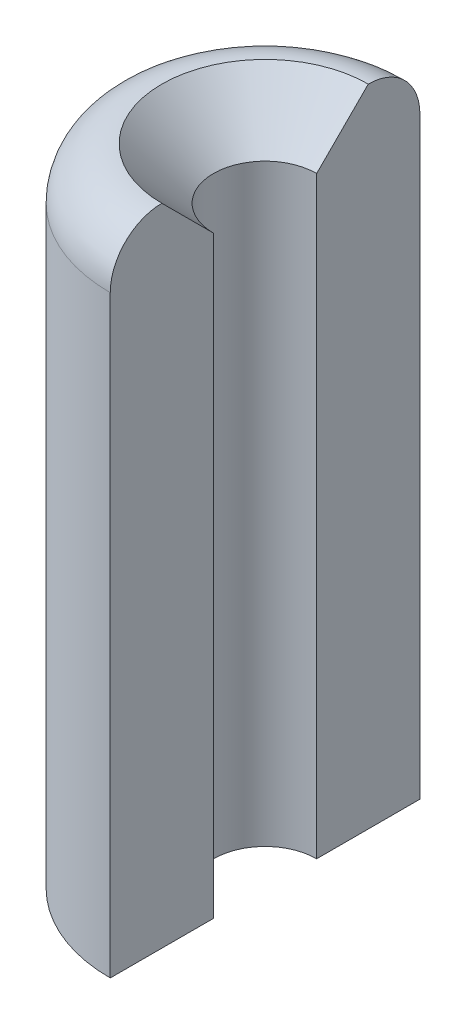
ISO-10303-21;
HEADER;
FILE_DESCRIPTION(('STEP AP214'),'2;1');
FILE_NAME('part.step','',(''),(''),'','','');
FILE_SCHEMA(('AUTOMOTIVE_DESIGN { 1 0 10303 214 1 1 1 1 }'));
ENDSEC;
DATA;
#1=APPLICATION_CONTEXT('core data for automotive mechanical design processes');
#2=APPLICATION_PROTOCOL_DEFINITION('international standard','automotive_design',2000,#1);
#3=PRODUCT_CONTEXT('',#1,'mechanical');
#4=PRODUCT('Part','Part','',(#3));
#5=PRODUCT_RELATED_PRODUCT_CATEGORY('part','',(#4));
#6=PRODUCT_DEFINITION_FORMATION('','',#4);
#7=PRODUCT_DEFINITION_CONTEXT('part definition',#1,'design');
#8=PRODUCT_DEFINITION('design','',#6,#7);
#9=PRODUCT_DEFINITION_SHAPE('','',#8);
#10=(LENGTH_UNIT() NAMED_UNIT(*) SI_UNIT(.MILLI.,.METRE.));
#11=(NAMED_UNIT(*) PLANE_ANGLE_UNIT() SI_UNIT($,.RADIAN.));
#12=(NAMED_UNIT(*) SI_UNIT($,.STERADIAN.) SOLID_ANGLE_UNIT());
#13=UNCERTAINTY_MEASURE_WITH_UNIT(LENGTH_MEASURE(1.E-05),#10,'distance_accuracy_value','');
#14=(GEOMETRIC_REPRESENTATION_CONTEXT(3) GLOBAL_UNCERTAINTY_ASSIGNED_CONTEXT((#13)) GLOBAL_UNIT_ASSIGNED_CONTEXT((#10,
#11,#12)) REPRESENTATION_CONTEXT('',''));
#15=CARTESIAN_POINT('',(0.,0.,0.));
#16=DIRECTION('',(0.,0.,1.));
#17=DIRECTION('',(1.,0.,0.));
#18=AXIS2_PLACEMENT_3D('',#15,#16,#17);
#19=CARTESIAN_POINT('',(0.,0.,-10.));
#20=DIRECTION('',(0.,-1.,0.));
#21=DIRECTION('',(0.,0.,-1.));
#22=AXIS2_PLACEMENT_3D('',#19,#20,#21);
#23=PLANE('',#22);
#24=DIRECTION('',(0.,0.,-1.));
#25=VECTOR('',#24,1.);
#26=CARTESIAN_POINT('',(-1.5,0.,1.26994984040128));
#27=LINE('',#26,#25);
#28=CARTESIAN_POINT('',(-1.5,0.,-2.));
#29=VERTEX_POINT('',#28);
#30=CARTESIAN_POINT('',(-1.5,1.1369377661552E-11,-4.));
#31=VERTEX_POINT('',#30);
#32=EDGE_CURVE('E56',#29,#31,#27,.T.);
#33=ORIENTED_EDGE('',*,*,#32,.F.);
#34=CARTESIAN_POINT('',(-1.5,0.,-5.));
#35=DIRECTION('',(0.,-1.,0.));
#36=DIRECTION('',(0.,0.,-1.));
#37=AXIS2_PLACEMENT_3D('',#34,#35,#36);
#38=CIRCLE('',#37,3.);
#39=CARTESIAN_POINT('',(-1.5,0.,-8.));
#40=VERTEX_POINT('',#39);
#41=EDGE_CURVE('E41',#29,#40,#38,.T.);
#42=ORIENTED_EDGE('',*,*,#41,.T.);
#43=CARTESIAN_POINT('',(-1.5,1.1369377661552E-11,-6.));
#44=VERTEX_POINT('',#43);
#45=EDGE_CURVE('E80',#44,#40,#27,.T.);
#46=ORIENTED_EDGE('',*,*,#45,.F.);
#47=CARTESIAN_POINT('',(-1.5,1.1369377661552E-11,-5.));
#48=DIRECTION('',(0.,1.,0.));
#49=DIRECTION('',(0.,0.,1.));
#50=AXIS2_PLACEMENT_3D('',#47,#48,#49);
#51=CIRCLE('',#50,0.999999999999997);
#52=EDGE_CURVE('E90',#44,#31,#51,.T.);
#53=ORIENTED_EDGE('',*,*,#52,.T.);
#54=EDGE_LOOP('',(#33,#42,#46,#53));
#55=FACE_BOUND('',#54,.T.);
#56=ADVANCED_FACE('F34',(#55),#23,.T.);
#57=CARTESIAN_POINT('',(-1.5,12.5,-5.));
#58=DIRECTION('',(0.,-1.,0.));
#59=DIRECTION('',(0.,0.,-1.));
#60=AXIS2_PLACEMENT_3D('',#57,#58,#59);
#61=CYLINDRICAL_SURFACE('',#60,3.);
#62=DIRECTION('',(0.,-1.,0.));
#63=VECTOR('',#62,1.);
#64=CARTESIAN_POINT('',(-1.5,0.,-2.));
#65=LINE('',#64,#63);
#66=CARTESIAN_POINT('',(-1.5,11.5,-2.));
#67=VERTEX_POINT('',#66);
#68=EDGE_CURVE('E108',#67,#29,#65,.T.);
#69=ORIENTED_EDGE('',*,*,#68,.F.);
#70=CARTESIAN_POINT('',(-1.5,11.5,-5.));
#71=DIRECTION('',(0.,-1.,0.));
#72=DIRECTION('',(0.,0.,-1.));
#73=AXIS2_PLACEMENT_3D('',#70,#71,#72);
#74=CIRCLE('',#73,3.);
#75=CARTESIAN_POINT('',(-1.5,11.5,-8.));
#76=VERTEX_POINT('',#75);
#77=EDGE_CURVE('E13',#67,#76,#74,.T.);
#78=ORIENTED_EDGE('',*,*,#77,.T.);
#79=DIRECTION('',(0.,1.,0.));
#80=VECTOR('',#79,1.);
#81=CARTESIAN_POINT('',(-1.5,0.,-8.));
#82=LINE('',#81,#80);
#83=EDGE_CURVE('E107',#40,#76,#82,.T.);
#84=ORIENTED_EDGE('',*,*,#83,.F.);
#85=ORIENTED_EDGE('',*,*,#41,.F.);
#86=EDGE_LOOP('',(#69,#78,#84,#85));
#87=FACE_BOUND('',#86,.T.);
#88=ADVANCED_FACE('F119',(#87),#61,.T.);
#89=CARTESIAN_POINT('',(-1.5,11.5,-5.));
#90=DIRECTION('',(0.,-1.,0.));
#91=DIRECTION('',(0.,0.,-1.));
#92=AXIS2_PLACEMENT_3D('',#89,#90,#91);
#93=TOROIDAL_SURFACE('',#92,2.,1.);
#94=CARTESIAN_POINT('',(-1.5,11.5,-3.));
#95=DIRECTION('',(-1.,0.,0.));
#96=DIRECTION('',(0.,0.,1.));
#97=AXIS2_PLACEMENT_3D('',#94,#95,#96);
#98=CIRCLE('',#97,1.);
#99=CARTESIAN_POINT('',(-1.5,12.5,-3.));
#100=VERTEX_POINT('',#99);
#101=EDGE_CURVE('E96',#67,#100,#98,.T.);
#102=ORIENTED_EDGE('',*,*,#101,.T.);
#103=CARTESIAN_POINT('',(-1.5,12.5,-5.));
#104=DIRECTION('',(0.,1.,0.));
#105=DIRECTION('',(0.,0.,1.));
#106=AXIS2_PLACEMENT_3D('',#103,#104,#105);
#107=CIRCLE('',#106,2.);
#108=CARTESIAN_POINT('',(-1.5,12.5,-7.));
#109=VERTEX_POINT('',#108);
#110=EDGE_CURVE('E98',#109,#100,#107,.T.);
#111=ORIENTED_EDGE('',*,*,#110,.F.);
#112=CARTESIAN_POINT('',(-1.5,11.5,-7.));
#113=DIRECTION('',(-1.,0.,0.));
#114=DIRECTION('',(0.,0.,1.));
#115=AXIS2_PLACEMENT_3D('',#112,#113,#114);
#116=CIRCLE('',#115,1.);
#117=EDGE_CURVE('E111',#109,#76,#116,.T.);
#118=ORIENTED_EDGE('',*,*,#117,.T.);
#119=ORIENTED_EDGE('',*,*,#77,.F.);
#120=EDGE_LOOP('',(#102,#111,#118,#119));
#121=FACE_BOUND('',#120,.T.);
#122=ADVANCED_FACE('F116',(#121),#93,.T.);
#123=CARTESIAN_POINT('',(-1.5,12.5,-5.));
#124=DIRECTION('',(0.,1.,0.));
#125=DIRECTION('',(0.,0.,1.));
#126=AXIS2_PLACEMENT_3D('',#123,#124,#125);
#127=CONICAL_SURFACE('',#126,2.,0.785398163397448);
#128=ORIENTED_EDGE('',*,*,#110,.T.);
#129=DIRECTION('',(0.,0.707106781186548,0.707106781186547));
#130=VECTOR('',#129,1.);
#131=CARTESIAN_POINT('',(-1.5,10.5,-5.));
#132=LINE('',#131,#130);
#133=CARTESIAN_POINT('',(-1.5,11.5,-4.));
#134=VERTEX_POINT('',#133);
#135=EDGE_CURVE('E101',#134,#100,#132,.T.);
#136=ORIENTED_EDGE('',*,*,#135,.F.);
#137=CARTESIAN_POINT('',(-1.5,11.5,-5.));
#138=DIRECTION('',(0.,1.,0.));
#139=DIRECTION('',(0.,0.,1.));
#140=AXIS2_PLACEMENT_3D('',#137,#138,#139);
#141=CIRCLE('',#140,0.999999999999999);
#142=CARTESIAN_POINT('',(-1.5,11.5,-6.));
#143=VERTEX_POINT('',#142);
#144=EDGE_CURVE('E95',#143,#134,#141,.T.);
#145=ORIENTED_EDGE('',*,*,#144,.F.);
#146=DIRECTION('',(0.,-0.707106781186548,0.707106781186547));
#147=VECTOR('',#146,1.);
#148=CARTESIAN_POINT('',(-1.5,10.5,-5.));
#149=LINE('',#148,#147);
#150=EDGE_CURVE('E48',#109,#143,#149,.T.);
#151=ORIENTED_EDGE('',*,*,#150,.F.);
#152=EDGE_LOOP('',(#128,#136,#145,#151));
#153=FACE_BOUND('',#152,.T.);
#154=ADVANCED_FACE('F125',(#153),#127,.F.);
#155=CARTESIAN_POINT('',(-1.5,12.5,-5.));
#156=DIRECTION('',(0.,1.,0.));
#157=DIRECTION('',(0.,0.,1.));
#158=AXIS2_PLACEMENT_3D('',#155,#156,#157);
#159=CYLINDRICAL_SURFACE('',#158,0.999999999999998);
#160=ORIENTED_EDGE('',*,*,#144,.T.);
#161=DIRECTION('',(0.,1.,0.));
#162=VECTOR('',#161,1.);
#163=CARTESIAN_POINT('',(-1.5,12.5,-4.));
#164=LINE('',#163,#162);
#165=EDGE_CURVE('E94',#31,#134,#164,.T.);
#166=ORIENTED_EDGE('',*,*,#165,.F.);
#167=ORIENTED_EDGE('',*,*,#52,.F.);
#168=DIRECTION('',(0.,1.,0.));
#169=VECTOR('',#168,1.);
#170=CARTESIAN_POINT('',(-1.5,12.5,-6.));
#171=LINE('',#170,#169);
#172=EDGE_CURVE('E77',#143,#44,#171,.F.);
#173=ORIENTED_EDGE('',*,*,#172,.F.);
#174=EDGE_LOOP('',(#160,#166,#167,#173));
#175=FACE_BOUND('',#174,.T.);
#176=ADVANCED_FACE('F93',(#175),#159,.F.);
#177=CARTESIAN_POINT('',(-1.5,14.2990196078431,1.26994984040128));
#178=DIRECTION('',(-1.,0.,0.));
#179=DIRECTION('',(0.,0.,1.));
#180=AXIS2_PLACEMENT_3D('',#177,#178,#179);
#181=PLANE('',#180);
#182=ORIENTED_EDGE('',*,*,#83,.T.);
#183=ORIENTED_EDGE('',*,*,#117,.F.);
#184=ORIENTED_EDGE('',*,*,#150,.T.);
#185=ORIENTED_EDGE('',*,*,#172,.T.);
#186=ORIENTED_EDGE('',*,*,#45,.T.);
#187=EDGE_LOOP('',(#182,#183,#184,#185,#186));
#188=FACE_BOUND('',#187,.T.);
#189=ADVANCED_FACE('F79',(#188),#181,.F.);
#190=ORIENTED_EDGE('',*,*,#68,.T.);
#191=ORIENTED_EDGE('',*,*,#32,.T.);
#192=ORIENTED_EDGE('',*,*,#165,.T.);
#193=ORIENTED_EDGE('',*,*,#135,.T.);
#194=ORIENTED_EDGE('',*,*,#101,.F.);
#195=EDGE_LOOP('',(#190,#191,#192,#193,#194));
#196=FACE_BOUND('',#195,.T.);
#197=ADVANCED_FACE('F120',(#196),#181,.F.);
#198=CLOSED_SHELL('',(#56,#88,#122,#154,#176,#189,#197));
#199=MANIFOLD_SOLID_BREP('B2',#198);
#200=ADVANCED_BREP_SHAPE_REPRESENTATION('',(#18,#199),#14);
#201=SHAPE_DEFINITION_REPRESENTATION(#9,#200);
ENDSEC;
END-ISO-10303-21;
